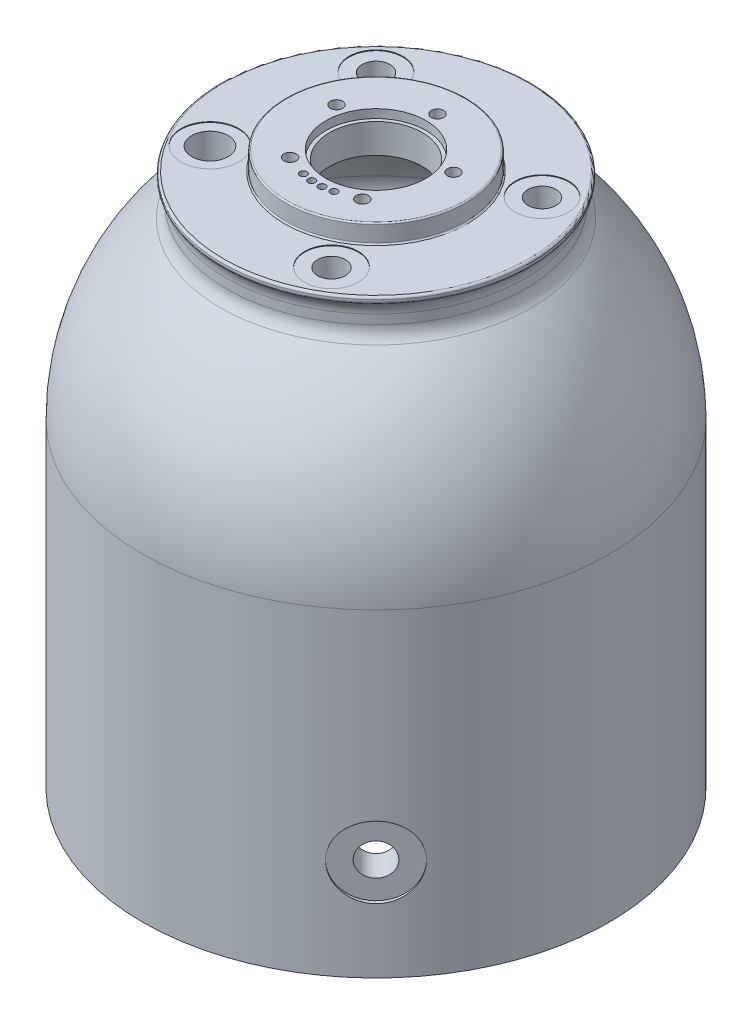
from build123d import *

# Parameters (mm, degrees)
CUT_EXTRUDE1_REACH  = 233.366
SKETCH2_R           = 2.1971
CIRPATTERN1_COUNT   = 5
CUT_EXTRUDE2_REACH  = 233.366
SKETCH3_R           = 1.27
CIRPATTERN2_COUNT   = 4
CIRPATTERN2_ANGLE   = 30
SKETCH4_R           = 17.78
CUT_EXTRUDE3_DEPTH  = 3.048
CUT_EXTRUDE4_REACH  = 230.744
SKETCH5_R           = 16.51
SKETCH12_R          = 4.96062
CUT_EXTRUDE5_DEPTH  = 50.8
SKETCH22_R          = 9.525
CUT_EXTRUDE12_DEPTH = 0.254
SKETCH27_R          = 4.96062
CUT_EXTRUDE17_DEPTH = 50.8
SKETCH28_R          = 4.96062
CUT_EXTRUDE18_DEPTH = 50.8
SKETCH29_R          = 6.5024
CUT_EXTRUDE19_DEPTH = 50.8
SKETCH30_R          = 9.525
CUT_EXTRUDE20_DEPTH = 0.254
SKETCH31_R          = 9.525
CUT_EXTRUDE21_DEPTH = 0.254
SKETCH32_R          = 10.287
CUT_EXTRUDE22_DEPTH = 0.254
SKETCH34_R          = 5.7546875
CUT_EXTRUDE23_DEPTH = 232.366011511
SKETCH36_R          = 12.7
CUT_EXTRUDE24_DEPTH = 1.27


with BuildPart() as part:
    # Sketch1 → Base-Revolve (revolve)
    with BuildSketch(Plane.XY, mode=Mode.PRIVATE) as base_revolve_sk:
        with BuildLine():
            Line((-72.0725, 0), (-73.66, 0))
            Line((-73.66, 0), (-73.66, 3.175))
            Line((-73.66, 3.175), (-76.2, 3.175))
            Line((-76.2, 3.175), (-76.2, 5.1054))
            Line((-76.2, 5.1054), (-79.7306, 5.1054))
            Line((-79.7306, 5.1054), (-79.7306, 3.175))
            Line((-79.7306, 3.175), (-82.90814, 3.175))
            Line((-82.90814, 3.175), (-82.90814, 116.41074))
            ThreePointArc((-82.90814, 116.41074), (-75.659717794, 150.313301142), (-55.1815, 178.28768))
            ThreePointArc((-55.1815, 178.28768), (-53.61306628, 180.430483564), (-53.05806, 183.02732))
            Line((-53.05806, 183.02732), (-53.05806, 186.3344))
            ThreePointArc((-53.05806, 186.3344), (-53.468292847, 188.688049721), (-54.71922, 190.72352))
            ThreePointArc((-54.71922, 190.72352), (-54.873680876, 190.97193402), (-54.9275, 191.25946))
            Line((-54.9275, 191.25946), (-54.9275, 192.05956))
            ThreePointArc((-54.9275, 192.05956), (-54.694490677, 192.620827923), (-54.13248, 192.85204))
            Line((-54.13248, 192.85204), (-32.512, 192.85204))
            ThreePointArc((-32.512, 192.85204), (-32.152789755, 193.000829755), (-32.004, 193.36004))
            Line((-32.004, 193.36004), (-32.004, 198.94804))
            ThreePointArc((-32.004, 198.94804), (-31.855210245, 199.307250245), (-31.496, 199.45604))
            Line((-31.496, 199.45604), (0, 199.45604))
            Line((0, 199.45604), (0, 185.99404))
            Line((0, 185.99404), (-31.06166, 185.99404))
            ThreePointArc((-31.06166, 185.99404), (-56.586770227, 167.446891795), (-72.41032, 140.14958))
            ThreePointArc((-72.41032, 140.14958), (-73.03688079, 136.541673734), (-72.607962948, 132.904972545))
            Line((-72.607962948, 132.904972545), (-70.94474, 126.69774))
            Line((-70.94474, 126.69774), (-70.94474, 14.69644))
            Line((-70.94474, 14.69644), (-69.85, 12.8016))
            Line((-69.85, 12.8016), (-69.85, 9.6266))
            Line((-69.85, 9.6266), (-71.6026, 9.6266))
            Line((-71.6026, 9.6266), (-71.6026, 7.874))
            Line((-71.6026, 7.874), (-69.85, 7.874))
            Line((-69.85, 7.874), (-69.85, 3.84948292))
            Line((-69.85, 3.84948292), (-72.0725, 0))
        make_face()
    revolve(base_revolve_sk.sketch.rotate(Axis((0, 0, 0), (0, 1, 0)), 270), axis=Axis((0, 0, 0), (0, 1, 0)))

    # Sketch2 → Cut-Extrude1 (cut, up to next)
    with BuildSketch(Plane(origin=(0, 199.45604, 0), x_dir=(-1, 0, 0), z_dir=(0, 1, 0)), mode=Mode.PRIVATE) as cut_extrude1_sk1:
        with Locations(Location((0, -21.844, 0), (0, 0, 90))):
            Circle(SKETCH2_R)
    cut_extrude1_tool1 = extrude(cut_extrude1_sk1.sketch, amount=-CUT_EXTRUDE1_REACH, mode=Mode.PRIVATE) & part.part
    cut_extrude1 = cut_extrude1_tool1.solids().sort_by_distance((0, 199.45604, -21.844))[0]
    add(cut_extrude1, mode=Mode.SUBTRACT)

    # CirPattern1: Cut-Extrude1 ×5 about axis
    cirpattern1_axis = Axis((0, 0, 0), (0, 1, 0))
    for i in range(1, CIRPATTERN1_COUNT):
        add(cut_extrude1.rotate(cirpattern1_axis, i * 360 / CIRPATTERN1_COUNT), mode=Mode.SUBTRACT)

    # Sketch3 → Cut-Extrude2 (cut, up to next)
    with BuildSketch(Plane(origin=(0, 199.45604, 0), x_dir=(-1, 0, 0), z_dir=(0, 1, 0)), mode=Mode.PRIVATE) as cut_extrude2_sk1:
        with Locations(Location((5.456423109, 20.36364827, 0), (0, 0, 90))):
            Circle(SKETCH3_R)
    cut_extrude2_tool1 = extrude(cut_extrude2_sk1.sketch, amount=-CUT_EXTRUDE2_REACH, mode=Mode.PRIVATE) & part.part
    cut_extrude2 = cut_extrude2_tool1.solids().sort_by_distance((-5.456423, 199.45604, 20.363648))[0]
    add(cut_extrude2, mode=Mode.SUBTRACT)

    # CirPattern2: Cut-Extrude2 ×4 about axis
    cirpattern2_axis = Axis((0, 0, 0), (0, 1, 0))
    for i in range(1, CIRPATTERN2_COUNT):
        add(cut_extrude2.rotate(cirpattern2_axis, i * CIRPATTERN2_ANGLE / (CIRPATTERN2_COUNT - 1)), mode=Mode.SUBTRACT)

    # Sketch4 → Cut-Extrude3 (cut)
    with BuildSketch(Plane(origin=(0, 199.45604, 0), x_dir=(-1, 0, 0), z_dir=(0, 1, 0))):
        with Locations(Location((0, 0, 0), (0, 0, 90))):
            Circle(SKETCH4_R)
    extrude(amount=-CUT_EXTRUDE3_DEPTH, mode=Mode.SUBTRACT)

    # Sketch5 → Cut-Extrude4 (cut, up to next)
    with BuildSketch(Plane(origin=(0, 196.40804, 0), x_dir=(-1, 0, 0), z_dir=(0, 1, 0)), mode=Mode.PRIVATE) as cut_extrude4_sk1:
        with Locations(Location((0, 0, 0), (0, 0, 90))):
            Circle(SKETCH5_R)
    cut_extrude4_tool1 = extrude(cut_extrude4_sk1.sketch, amount=-CUT_EXTRUDE4_REACH, mode=Mode.PRIVATE) & part.part
    add(cut_extrude4_tool1.solids().sort_by_distance((0, 196.40804, 0))[0], mode=Mode.SUBTRACT)

    # Sketch12 → Cut-Extrude5 (cut)
    with BuildSketch(Plane(origin=(0, 192.85204, 0), x_dir=(-1, 0, 0), z_dir=(0, 1, 0))):
        with Locations(Location((30.532870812, -30.532870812, 0), (0, 0, 90))):
            Circle(SKETCH12_R)
    extrude(amount=-CUT_EXTRUDE5_DEPTH, mode=Mode.SUBTRACT)

    # Sketch22 → Cut-Extrude12 (cut)
    with BuildSketch(Plane(origin=(0, 192.85204, 0), x_dir=(-1, 0, 0), z_dir=(0, 1, 0))):
        with Locations(Location((30.532870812, -30.532870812, 0), (0, 0, 90))):
            Circle(SKETCH22_R)
    extrude(amount=-CUT_EXTRUDE12_DEPTH, mode=Mode.SUBTRACT)

    # Sketch27 → Cut-Extrude17 (cut)
    with BuildSketch(Plane(origin=(0, 192.85204, 0), x_dir=(-1, 0, 0), z_dir=(0, 1, 0))):
        with Locations(Location((-37.394976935, -21.59, 0), (0, 0, 90))):
            Circle(SKETCH27_R)
    extrude(amount=-CUT_EXTRUDE17_DEPTH, mode=Mode.SUBTRACT)

    # Sketch28 → Cut-Extrude18 (cut)
    with BuildSketch(Plane(origin=(0, 192.85204, 0), x_dir=(-1, 0, 0), z_dir=(0, 1, 0))):
        with Locations(Location((-21.59, 37.394976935, 0), (0, 0, 90))):
            Circle(SKETCH28_R)
    extrude(amount=-CUT_EXTRUDE18_DEPTH, mode=Mode.SUBTRACT)

    # Sketch29 → Cut-Extrude19 (cut)
    with BuildSketch(Plane(origin=(0, 192.85204, 0), x_dir=(-1, 0, 0), z_dir=(0, 1, 0))):
        with Locations(Location((37.394976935, 21.59, 0), (0, 0, 90))):
            Circle(SKETCH29_R)
    extrude(amount=-CUT_EXTRUDE19_DEPTH, mode=Mode.SUBTRACT)

    # Sketch30 → Cut-Extrude20 (cut)
    with BuildSketch(Plane(origin=(0, 192.85204, 0), x_dir=(-1, 0, 0), z_dir=(0, 1, 0))):
        with Locations(Location((-37.394976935, -21.59, 0), (0, 0, 90))):
            Circle(SKETCH30_R)
    extrude(amount=-CUT_EXTRUDE20_DEPTH, mode=Mode.SUBTRACT)

    # Sketch31 → Cut-Extrude21 (cut)
    with BuildSketch(Plane(origin=(0, 192.85204, 0), x_dir=(-1, 0, 0), z_dir=(0, 1, 0))):
        with Locations(Location((-21.59, 37.394976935, 0), (0, 0, 90))):
            Circle(SKETCH31_R)
    extrude(amount=-CUT_EXTRUDE21_DEPTH, mode=Mode.SUBTRACT)

    # Sketch32 → Cut-Extrude22 (cut)
    with BuildSketch(Plane(origin=(0, 192.85204, 0), x_dir=(-1, 0, 0), z_dir=(0, 1, 0))):
        with Locations(Location((37.394976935, 21.59, 0), (0, 0, 90))):
            Circle(SKETCH32_R)
    extrude(amount=-CUT_EXTRUDE22_DEPTH, mode=Mode.SUBTRACT)

    # Sketch34 → Cut-Extrude23 (cut, through all)
    with BuildSketch(Plane(origin=(0, 0, 0), x_dir=(0.7071067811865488, 0, -0.7071067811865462), z_dir=(0.7071067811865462, 0, 0.7071067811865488))):
        with Locations(Location((0, 38.735, 0), (0, 0, 180))):
            Circle(SKETCH34_R)
    extrude(amount=CUT_EXTRUDE23_DEPTH, mode=Mode.SUBTRACT)

    # Sketch36 → Cut-Extrude24 (cut)
    with BuildSketch(Plane(origin=(58.62490801, 43.297101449, 58.62490801), x_dir=(0.7071067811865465, 0, -0.7071067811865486), z_dir=(0.7071067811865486, 0, 0.7071067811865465))):
        with Locations((0, -4.562101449)):
            Circle(SKETCH36_R)
    extrude(amount=-CUT_EXTRUDE24_DEPTH, mode=Mode.SUBTRACT)


solid = part.part
